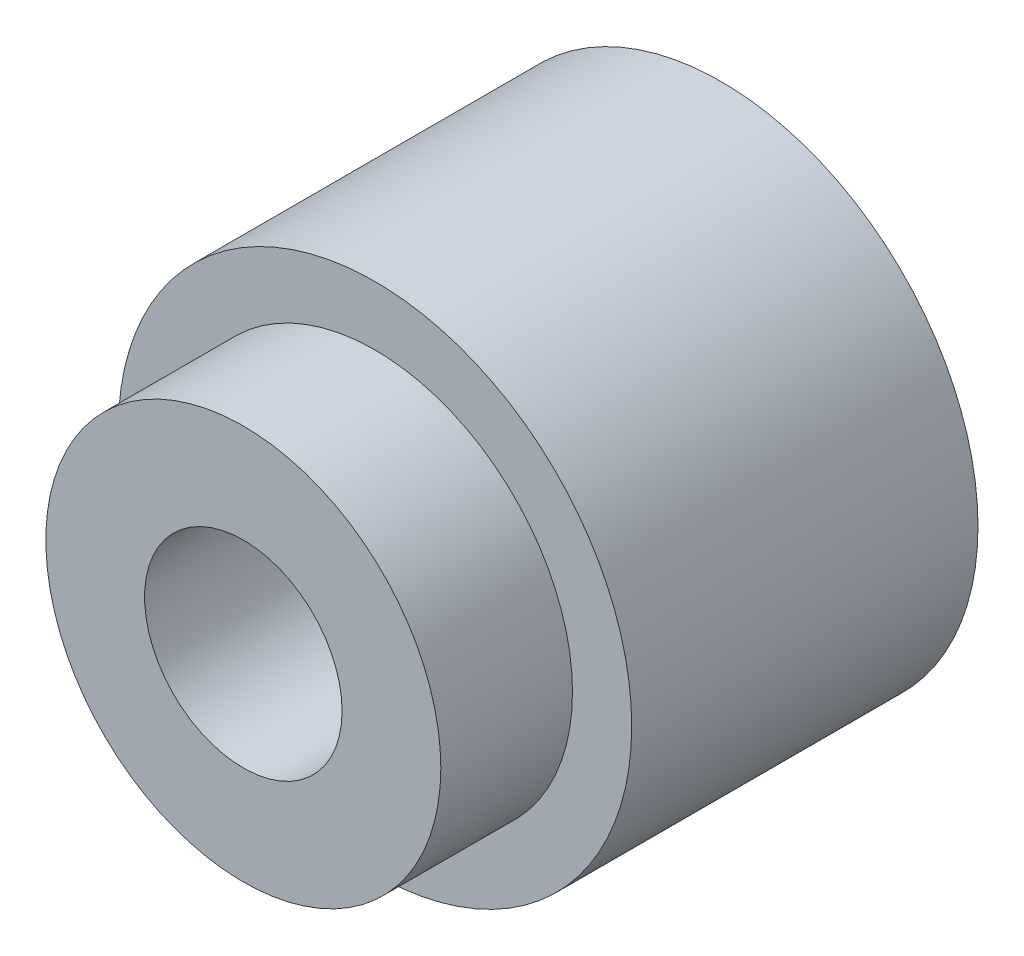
ISO-10303-21;
HEADER;
FILE_DESCRIPTION(('STEP AP214'),'2;1');
FILE_NAME('part.step','',(''),(''),'','','');
FILE_SCHEMA(('AUTOMOTIVE_DESIGN { 1 0 10303 214 1 1 1 1 }'));
ENDSEC;
DATA;
#1=APPLICATION_CONTEXT('core data for automotive mechanical design processes');
#2=APPLICATION_PROTOCOL_DEFINITION('international standard','automotive_design',2000,#1);
#3=PRODUCT_CONTEXT('',#1,'mechanical');
#4=PRODUCT('Part','Part','',(#3));
#5=PRODUCT_RELATED_PRODUCT_CATEGORY('part','',(#4));
#6=PRODUCT_DEFINITION_FORMATION('','',#4);
#7=PRODUCT_DEFINITION_CONTEXT('part definition',#1,'design');
#8=PRODUCT_DEFINITION('design','',#6,#7);
#9=PRODUCT_DEFINITION_SHAPE('','',#8);
#10=(LENGTH_UNIT() NAMED_UNIT(*) SI_UNIT(.MILLI.,.METRE.));
#11=(NAMED_UNIT(*) PLANE_ANGLE_UNIT() SI_UNIT($,.RADIAN.));
#12=(NAMED_UNIT(*) SI_UNIT($,.STERADIAN.) SOLID_ANGLE_UNIT());
#13=UNCERTAINTY_MEASURE_WITH_UNIT(LENGTH_MEASURE(1.E-05),#10,'distance_accuracy_value','');
#14=(GEOMETRIC_REPRESENTATION_CONTEXT(3) GLOBAL_UNCERTAINTY_ASSIGNED_CONTEXT((#13)) GLOBAL_UNIT_ASSIGNED_CONTEXT((#10,
#11,#12)) REPRESENTATION_CONTEXT('',''));
#15=CARTESIAN_POINT('',(0.,0.,0.));
#16=DIRECTION('',(0.,0.,1.));
#17=DIRECTION('',(1.,0.,0.));
#18=AXIS2_PLACEMENT_3D('',#15,#16,#17);
#19=CARTESIAN_POINT('',(0.,0.,0.));
#20=DIRECTION('',(0.,0.,1.));
#21=DIRECTION('',(1.,0.,0.));
#22=AXIS2_PLACEMENT_3D('',#19,#20,#21);
#23=PLANE('',#22);
#24=CARTESIAN_POINT('',(0.,0.,0.));
#25=DIRECTION('',(0.,0.,1.));
#26=DIRECTION('',(1.,0.,0.));
#27=AXIS2_PLACEMENT_3D('',#24,#25,#26);
#28=CIRCLE('',#27,3.9);
#29=CARTESIAN_POINT('',(3.9,0.,0.));
#30=VERTEX_POINT('',#29);
#31=EDGE_CURVE('E353',#30,#30,#28,.T.);
#32=ORIENTED_EDGE('',*,*,#31,.T.);
#33=EDGE_LOOP('',(#32));
#34=FACE_BOUND('',#33,.T.);
#35=CARTESIAN_POINT('',(0.,0.,0.));
#36=DIRECTION('',(0.,0.,1.));
#37=DIRECTION('',(1.,0.,0.));
#38=AXIS2_PLACEMENT_3D('',#35,#36,#37);
#39=CIRCLE('',#38,3.);
#40=CARTESIAN_POINT('',(3.,0.,0.));
#41=VERTEX_POINT('',#40);
#42=EDGE_CURVE('E361',#41,#41,#39,.T.);
#43=ORIENTED_EDGE('',*,*,#42,.F.);
#44=EDGE_LOOP('',(#43));
#45=FACE_BOUND('',#44,.T.);
#46=ADVANCED_FACE('F346',(#34,#45),#23,.T.);
#47=CARTESIAN_POINT('',(0.,0.,-5.26));
#48=DIRECTION('',(0.,0.,1.));
#49=DIRECTION('',(1.,0.,0.));
#50=AXIS2_PLACEMENT_3D('',#47,#48,#49);
#51=CYLINDRICAL_SURFACE('',#50,3.9);
#52=CARTESIAN_POINT('',(0.,0.,-5.26));
#53=DIRECTION('',(0.,0.,1.));
#54=DIRECTION('',(1.,0.,0.));
#55=AXIS2_PLACEMENT_3D('',#52,#53,#54);
#56=CIRCLE('',#55,3.9);
#57=CARTESIAN_POINT('',(3.9,0.,-5.26));
#58=VERTEX_POINT('',#57);
#59=EDGE_CURVE('E10',#58,#58,#56,.T.);
#60=ORIENTED_EDGE('',*,*,#59,.T.);
#61=EDGE_LOOP('',(#60));
#62=FACE_BOUND('',#61,.T.);
#63=ORIENTED_EDGE('',*,*,#31,.F.);
#64=EDGE_LOOP('',(#63));
#65=FACE_BOUND('',#64,.T.);
#66=ADVANCED_FACE('F348',(#62,#65),#51,.T.);
#67=CARTESIAN_POINT('',(0.,0.,-5.26));
#68=DIRECTION('',(0.,0.,1.));
#69=DIRECTION('',(1.,0.,0.));
#70=AXIS2_PLACEMENT_3D('',#67,#68,#69);
#71=PLANE('',#70);
#72=CARTESIAN_POINT('',(0.,0.,-5.26));
#73=DIRECTION('',(0.,0.,1.));
#74=DIRECTION('',(1.,0.,0.));
#75=AXIS2_PLACEMENT_3D('',#72,#73,#74);
#76=CIRCLE('',#75,1.5);
#77=CARTESIAN_POINT('',(1.5,0.,-5.26));
#78=VERTEX_POINT('',#77);
#79=EDGE_CURVE('E366',#78,#78,#76,.T.);
#80=ORIENTED_EDGE('',*,*,#79,.T.);
#81=EDGE_LOOP('',(#80));
#82=FACE_BOUND('',#81,.T.);
#83=ORIENTED_EDGE('',*,*,#59,.F.);
#84=EDGE_LOOP('',(#83));
#85=FACE_BOUND('',#84,.T.);
#86=ADVANCED_FACE('F384',(#82,#85),#71,.F.);
#87=CARTESIAN_POINT('',(0.,0.,2.));
#88=DIRECTION('',(0.,0.,-1.));
#89=DIRECTION('',(-1.,0.,0.));
#90=AXIS2_PLACEMENT_3D('',#87,#88,#89);
#91=CYLINDRICAL_SURFACE('',#90,3.);
#92=CARTESIAN_POINT('',(0.,0.,2.));
#93=DIRECTION('',(0.,0.,1.));
#94=DIRECTION('',(1.,0.,0.));
#95=AXIS2_PLACEMENT_3D('',#92,#93,#94);
#96=CIRCLE('',#95,3.);
#97=CARTESIAN_POINT('',(3.,0.,2.));
#98=VERTEX_POINT('',#97);
#99=EDGE_CURVE('E357',#98,#98,#96,.T.);
#100=ORIENTED_EDGE('',*,*,#99,.F.);
#101=EDGE_LOOP('',(#100));
#102=FACE_BOUND('',#101,.T.);
#103=ORIENTED_EDGE('',*,*,#42,.T.);
#104=EDGE_LOOP('',(#103));
#105=FACE_BOUND('',#104,.T.);
#106=ADVANCED_FACE('F378',(#102,#105),#91,.T.);
#107=CARTESIAN_POINT('',(0.,0.,2.));
#108=DIRECTION('',(0.,0.,1.));
#109=DIRECTION('',(1.,0.,0.));
#110=AXIS2_PLACEMENT_3D('',#107,#108,#109);
#111=PLANE('',#110);
#112=CARTESIAN_POINT('',(0.,0.,2.));
#113=DIRECTION('',(0.,0.,1.));
#114=DIRECTION('',(1.,0.,0.));
#115=AXIS2_PLACEMENT_3D('',#112,#113,#114);
#116=CIRCLE('',#115,1.5);
#117=CARTESIAN_POINT('',(1.5,0.,2.));
#118=VERTEX_POINT('',#117);
#119=EDGE_CURVE('E369',#118,#118,#116,.T.);
#120=ORIENTED_EDGE('',*,*,#119,.F.);
#121=EDGE_LOOP('',(#120));
#122=FACE_BOUND('',#121,.T.);
#123=ORIENTED_EDGE('',*,*,#99,.T.);
#124=EDGE_LOOP('',(#123));
#125=FACE_BOUND('',#124,.T.);
#126=ADVANCED_FACE('F375',(#122,#125),#111,.T.);
#127=CARTESIAN_POINT('',(0.,0.,-5.26));
#128=DIRECTION('',(0.,0.,1.));
#129=DIRECTION('',(1.,0.,0.));
#130=AXIS2_PLACEMENT_3D('',#127,#128,#129);
#131=CYLINDRICAL_SURFACE('',#130,1.5);
#132=ORIENTED_EDGE('',*,*,#79,.F.);
#133=EDGE_LOOP('',(#132));
#134=FACE_BOUND('',#133,.T.);
#135=ORIENTED_EDGE('',*,*,#119,.T.);
#136=EDGE_LOOP('',(#135));
#137=FACE_BOUND('',#136,.T.);
#138=ADVANCED_FACE('F373',(#134,#137),#131,.F.);
#139=CLOSED_SHELL('',(#46,#66,#86,#106,#126,#138));
#140=MANIFOLD_SOLID_BREP('B2',#139);
#141=ADVANCED_BREP_SHAPE_REPRESENTATION('',(#18,#140),#14);
#142=SHAPE_DEFINITION_REPRESENTATION(#9,#141);
ENDSEC;
END-ISO-10303-21;
